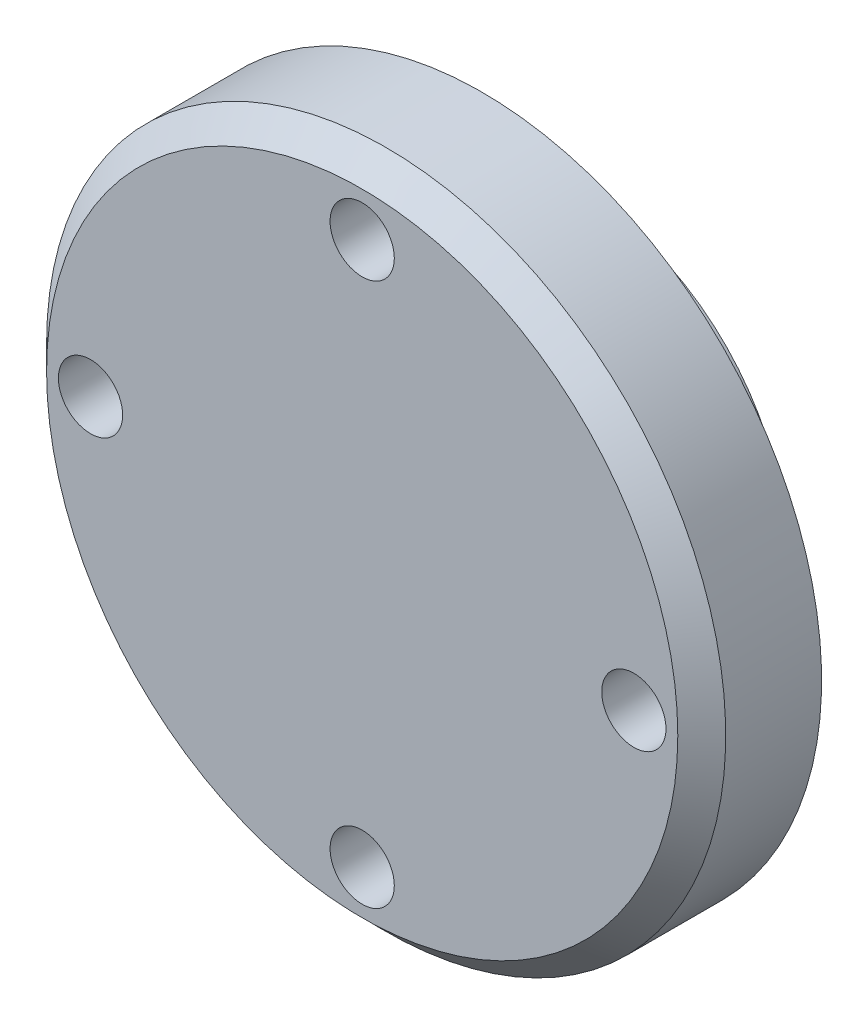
ISO-10303-21;
HEADER;
FILE_DESCRIPTION(('STEP AP214'),'2;1');
FILE_NAME('part.step','',(''),(''),'','','');
FILE_SCHEMA(('AUTOMOTIVE_DESIGN { 1 0 10303 214 1 1 1 1 }'));
ENDSEC;
DATA;
#1=APPLICATION_CONTEXT('core data for automotive mechanical design processes');
#2=APPLICATION_PROTOCOL_DEFINITION('international standard','automotive_design',2000,#1);
#3=PRODUCT_CONTEXT('',#1,'mechanical');
#4=PRODUCT('Part','Part','',(#3));
#5=PRODUCT_RELATED_PRODUCT_CATEGORY('part','',(#4));
#6=PRODUCT_DEFINITION_FORMATION('','',#4);
#7=PRODUCT_DEFINITION_CONTEXT('part definition',#1,'design');
#8=PRODUCT_DEFINITION('design','',#6,#7);
#9=PRODUCT_DEFINITION_SHAPE('','',#8);
#10=(LENGTH_UNIT() NAMED_UNIT(*) SI_UNIT(.MILLI.,.METRE.));
#11=(NAMED_UNIT(*) PLANE_ANGLE_UNIT() SI_UNIT($,.RADIAN.));
#12=(NAMED_UNIT(*) SI_UNIT($,.STERADIAN.) SOLID_ANGLE_UNIT());
#13=UNCERTAINTY_MEASURE_WITH_UNIT(LENGTH_MEASURE(1.E-05),#10,'distance_accuracy_value','');
#14=(GEOMETRIC_REPRESENTATION_CONTEXT(3) GLOBAL_UNCERTAINTY_ASSIGNED_CONTEXT((#13)) GLOBAL_UNIT_ASSIGNED_CONTEXT((#10,
#11,#12)) REPRESENTATION_CONTEXT('',''));
#15=CARTESIAN_POINT('',(0.,0.,0.));
#16=DIRECTION('',(0.,0.,1.));
#17=DIRECTION('',(1.,0.,0.));
#18=AXIS2_PLACEMENT_3D('',#15,#16,#17);
#19=CARTESIAN_POINT('',(0.,0.,-7.62));
#20=DIRECTION('',(0.,0.,1.));
#21=DIRECTION('',(1.,0.,0.));
#22=AXIS2_PLACEMENT_3D('',#19,#20,#21);
#23=CYLINDRICAL_SURFACE('',#22,16.5227);
#24=CARTESIAN_POINT('',(0.,0.,-2.413));
#25=DIRECTION('',(0.,0.,-1.));
#26=DIRECTION('',(-1.,0.,0.));
#27=AXIS2_PLACEMENT_3D('',#24,#25,#26);
#28=CIRCLE('',#27,16.5227);
#29=CARTESIAN_POINT('',(16.5227,0.,-2.413));
#30=VERTEX_POINT('',#29);
#31=EDGE_CURVE('E86',#30,#30,#28,.T.);
#32=CARTESIAN_POINT('',(0.,0.,0.));
#33=DIRECTION('',(0.,0.,1.));
#34=DIRECTION('',(1.,0.,0.));
#35=AXIS2_PLACEMENT_3D('',#32,#33,#34);
#36=CIRCLE('',#35,16.5227);
#37=CARTESIAN_POINT('',(16.5227,0.,0.));
#38=VERTEX_POINT('',#37);
#39=EDGE_CURVE('E74',#38,#38,#36,.F.);
#40=CARTESIAN_POINT('',(16.5227,0.,-2.413));
#41=CARTESIAN_POINT('',(16.5227,0.,-2.38786458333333));
#42=CARTESIAN_POINT('',(16.5227,0.,-2.36272916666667));
#43=CARTESIAN_POINT('',(16.5227,0.,-2.31245833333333));
#44=CARTESIAN_POINT('',(16.5227,0.,-2.28732291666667));
#45=CARTESIAN_POINT('',(16.5227,0.,-2.23705208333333));
#46=CARTESIAN_POINT('',(16.5227,0.,-2.21191666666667));
#47=CARTESIAN_POINT('',(16.5227,0.,-2.16164583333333));
#48=CARTESIAN_POINT('',(16.5227,0.,-2.13651041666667));
#49=CARTESIAN_POINT('',(16.5227,0.,-2.08623958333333));
#50=CARTESIAN_POINT('',(16.5227,0.,-2.06110416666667));
#51=CARTESIAN_POINT('',(16.5227,0.,-2.01083333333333));
#52=CARTESIAN_POINT('',(16.5227,0.,-1.98569791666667));
#53=CARTESIAN_POINT('',(16.5227,0.,-1.93542708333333));
#54=CARTESIAN_POINT('',(16.5227,0.,-1.91029166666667));
#55=CARTESIAN_POINT('',(16.5227,0.,-1.86002083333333));
#56=CARTESIAN_POINT('',(16.5227,0.,-1.83488541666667));
#57=CARTESIAN_POINT('',(16.5227,0.,-1.78461458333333));
#58=CARTESIAN_POINT('',(16.5227,0.,-1.75947916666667));
#59=CARTESIAN_POINT('',(16.5227,0.,-1.70920833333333));
#60=CARTESIAN_POINT('',(16.5227,0.,-1.68407291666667));
#61=CARTESIAN_POINT('',(16.5227,0.,-1.63380208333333));
#62=CARTESIAN_POINT('',(16.5227,0.,-1.60866666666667));
#63=CARTESIAN_POINT('',(16.5227,0.,-1.55839583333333));
#64=CARTESIAN_POINT('',(16.5227,0.,-1.53326041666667));
#65=CARTESIAN_POINT('',(16.5227,0.,-1.48298958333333));
#66=CARTESIAN_POINT('',(16.5227,0.,-1.45785416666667));
#67=CARTESIAN_POINT('',(16.5227,0.,-1.40758333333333));
#68=CARTESIAN_POINT('',(16.5227,0.,-1.38244791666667));
#69=CARTESIAN_POINT('',(16.5227,0.,-1.33217708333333));
#70=CARTESIAN_POINT('',(16.5227,0.,-1.30704166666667));
#71=CARTESIAN_POINT('',(16.5227,0.,-1.25677083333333));
#72=CARTESIAN_POINT('',(16.5227,0.,-1.23163541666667));
#73=CARTESIAN_POINT('',(16.5227,0.,-1.18136458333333));
#74=CARTESIAN_POINT('',(16.5227,0.,-1.15622916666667));
#75=CARTESIAN_POINT('',(16.5227,0.,-1.10595833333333));
#76=CARTESIAN_POINT('',(16.5227,0.,-1.08082291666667));
#77=CARTESIAN_POINT('',(16.5227,0.,-1.03055208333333));
#78=CARTESIAN_POINT('',(16.5227,0.,-1.00541666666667));
#79=CARTESIAN_POINT('',(16.5227,0.,-0.955145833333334));
#80=CARTESIAN_POINT('',(16.5227,0.,-0.930010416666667));
#81=CARTESIAN_POINT('',(16.5227,0.,-0.879739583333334));
#82=CARTESIAN_POINT('',(16.5227,0.,-0.854604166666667));
#83=CARTESIAN_POINT('',(16.5227,0.,-0.804333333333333));
#84=CARTESIAN_POINT('',(16.5227,0.,-0.779197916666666));
#85=CARTESIAN_POINT('',(16.5227,0.,-0.728927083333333));
#86=CARTESIAN_POINT('',(16.5227,0.,-0.703791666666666));
#87=CARTESIAN_POINT('',(16.5227,0.,-0.653520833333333));
#88=CARTESIAN_POINT('',(16.5227,0.,-0.628385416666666));
#89=CARTESIAN_POINT('',(16.5227,0.,-0.578114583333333));
#90=CARTESIAN_POINT('',(16.5227,0.,-0.552979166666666));
#91=CARTESIAN_POINT('',(16.5227,0.,-0.502708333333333));
#92=CARTESIAN_POINT('',(16.5227,0.,-0.477572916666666));
#93=CARTESIAN_POINT('',(16.5227,0.,-0.427302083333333));
#94=CARTESIAN_POINT('',(16.5227,0.,-0.402166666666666));
#95=CARTESIAN_POINT('',(16.5227,0.,-0.351895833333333));
#96=CARTESIAN_POINT('',(16.5227,0.,-0.326760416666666));
#97=CARTESIAN_POINT('',(16.5227,0.,-0.276489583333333));
#98=CARTESIAN_POINT('',(16.5227,0.,-0.251354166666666));
#99=CARTESIAN_POINT('',(16.5227,0.,-0.201083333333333));
#100=CARTESIAN_POINT('',(16.5227,0.,-0.175947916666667));
#101=CARTESIAN_POINT('',(16.5227,0.,-0.125677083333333));
#102=CARTESIAN_POINT('',(16.5227,0.,-0.100541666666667));
#103=CARTESIAN_POINT('',(16.5227,0.,-0.0502708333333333));
#104=CARTESIAN_POINT('',(16.5227,0.,-0.0251354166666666));
#105=CARTESIAN_POINT('',(16.5227,0.,0.));
#106=B_SPLINE_CURVE_WITH_KNOTS('',3,(#40,#41,#42,#43,#44,#45,#46,#47,#48,#49,#50,#51,#52,#53,
#54,#55,#56,#57,#58,#59,#60,#61,#62,#63,#64,#65,#66,#67,#68,#69,#70,#71,#72,#73,#74,#75,#76,#77,
#78,#79,#80,#81,#82,#83,#84,#85,#86,#87,#88,#89,#90,#91,#92,#93,#94,#95,#96,#97,#98,#99,#100,
#101,#102,#103,#104,#105),.UNSPECIFIED.,.F.,.F.,(4,2,2,2,2,2,2,2,2,2,2,2,2,2,2,2,2,2,2,2,2,2,2,
2,2,2,2,2,2,2,2,2,4),(0.,0.07540625,0.1508125,0.22621875,0.301625,0.37703125,0.4524375,
0.52784375,0.60325,0.67865625,0.7540625,0.82946875,0.904875,0.98028125,1.0556875,1.13109375,
1.2065,1.28190625,1.3573125,1.43271875,1.508125,1.58353125,1.6589375,1.73434375,1.80975,
1.88515625,1.9605625,2.03596875,2.111375,2.18678125,2.2621875,2.33759375,2.413),.UNSPECIFIED.);
#107=EDGE_CURVE('BSEAM63',#30,#38,#106,.T.);
#108=ORIENTED_EDGE('',*,*,#31,.F.);
#109=ORIENTED_EDGE('',*,*,#39,.T.);
#110=ORIENTED_EDGE('',*,*,#107,.T.);
#111=ORIENTED_EDGE('',*,*,#107,.F.);
#112=EDGE_LOOP('',(#108,#110,#109,#111));
#113=FACE_BOUND('',#112,.T.);
#114=ADVANCED_FACE('F63',(#113),#23,.T.);
#115=CARTESIAN_POINT('',(0.,0.,0.));
#116=DIRECTION('',(0.,0.,1.));
#117=DIRECTION('',(1.,0.,0.));
#118=AXIS2_PLACEMENT_3D('',#115,#116,#117);
#119=PLANE('',#118);
#120=CARTESIAN_POINT('',(0.,-21.59,0.));
#121=DIRECTION('',(0.,0.,1.));
#122=DIRECTION('',(1.,0.,0.));
#123=AXIS2_PLACEMENT_3D('',#120,#121,#122);
#124=CIRCLE('',#123,2.55269999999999);
#125=CARTESIAN_POINT('',(2.55269999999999,-21.59,0.));
#126=VERTEX_POINT('',#125);
#127=EDGE_CURVE('E116',#126,#126,#124,.T.);
#128=ORIENTED_EDGE('',*,*,#127,.T.);
#129=EDGE_LOOP('',(#128));
#130=FACE_BOUND('',#129,.T.);
#131=CARTESIAN_POINT('',(21.59,0.,0.));
#132=DIRECTION('',(0.,0.,1.));
#133=DIRECTION('',(1.,0.,0.));
#134=AXIS2_PLACEMENT_3D('',#131,#132,#133);
#135=CIRCLE('',#134,2.55269999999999);
#136=CARTESIAN_POINT('',(24.1427,0.,0.));
#137=VERTEX_POINT('',#136);
#138=EDGE_CURVE('E110',#137,#137,#135,.T.);
#139=ORIENTED_EDGE('',*,*,#138,.T.);
#140=EDGE_LOOP('',(#139));
#141=FACE_BOUND('',#140,.T.);
#142=CARTESIAN_POINT('',(0.,21.59,0.));
#143=DIRECTION('',(0.,0.,1.));
#144=DIRECTION('',(1.,0.,0.));
#145=AXIS2_PLACEMENT_3D('',#142,#143,#144);
#146=CIRCLE('',#145,2.55269999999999);
#147=CARTESIAN_POINT('',(2.55269999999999,21.59,0.));
#148=VERTEX_POINT('',#147);
#149=EDGE_CURVE('E104',#148,#148,#146,.T.);
#150=ORIENTED_EDGE('',*,*,#149,.T.);
#151=EDGE_LOOP('',(#150));
#152=FACE_BOUND('',#151,.T.);
#153=CARTESIAN_POINT('',(-21.59,0.,0.));
#154=DIRECTION('',(0.,0.,1.));
#155=DIRECTION('',(1.,0.,0.));
#156=AXIS2_PLACEMENT_3D('',#153,#154,#155);
#157=CIRCLE('',#156,2.55269999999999);
#158=CARTESIAN_POINT('',(-19.0373,0.,0.));
#159=VERTEX_POINT('',#158);
#160=EDGE_CURVE('E98',#159,#159,#157,.T.);
#161=ORIENTED_EDGE('',*,*,#160,.T.);
#162=EDGE_LOOP('',(#161));
#163=FACE_BOUND('',#162,.T.);
#164=CARTESIAN_POINT('',(0.,0.,0.));
#165=DIRECTION('',(0.,0.,1.));
#166=DIRECTION('',(1.,0.,0.));
#167=AXIS2_PLACEMENT_3D('',#164,#165,#166);
#168=CIRCLE('',#167,26.9875);
#169=CARTESIAN_POINT('',(-26.9875,0.,0.));
#170=VERTEX_POINT('',#169);
#171=EDGE_CURVE('E78',#170,#170,#168,.T.);
#172=ORIENTED_EDGE('',*,*,#171,.F.);
#173=EDGE_LOOP('',(#172));
#174=FACE_BOUND('',#173,.T.);
#175=ORIENTED_EDGE('',*,*,#39,.F.);
#176=EDGE_LOOP('',(#175));
#177=FACE_BOUND('',#176,.T.);
#178=ADVANCED_FACE('F156',(#130,#141,#152,#163,#174,#177),#119,.F.);
#179=CARTESIAN_POINT('',(0.,0.,9.525));
#180=DIRECTION('',(0.,0.,-1.));
#181=DIRECTION('',(-1.,0.,0.));
#182=AXIS2_PLACEMENT_3D('',#179,#180,#181);
#183=CYLINDRICAL_SURFACE('',#182,26.9875);
#184=CARTESIAN_POINT('',(0.,0.,7.62000000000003));
#185=DIRECTION('',(0.,0.,1.));
#186=DIRECTION('',(1.,0.,0.));
#187=AXIS2_PLACEMENT_3D('',#184,#185,#186);
#188=CIRCLE('',#187,26.9875);
#189=CARTESIAN_POINT('',(-26.9875,0.,7.62000000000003));
#190=VERTEX_POINT('',#189);
#191=EDGE_CURVE('E11',#190,#190,#188,.F.);
#192=CARTESIAN_POINT('',(-26.9875,0.,7.62000000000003));
#193=CARTESIAN_POINT('',(-26.9875,0.,7.54062500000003));
#194=CARTESIAN_POINT('',(-26.9875,0.,7.46125000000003));
#195=CARTESIAN_POINT('',(-26.9875,0.,7.30250000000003));
#196=CARTESIAN_POINT('',(-26.9875,0.,7.22312500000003));
#197=CARTESIAN_POINT('',(-26.9875,0.,7.06437500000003));
#198=CARTESIAN_POINT('',(-26.9875,0.,6.98500000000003));
#199=CARTESIAN_POINT('',(-26.9875,0.,6.82625000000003));
#200=CARTESIAN_POINT('',(-26.9875,0.,6.74687500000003));
#201=CARTESIAN_POINT('',(-26.9875,0.,6.58812500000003));
#202=CARTESIAN_POINT('',(-26.9875,0.,6.50875000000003));
#203=CARTESIAN_POINT('',(-26.9875,0.,6.35000000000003));
#204=CARTESIAN_POINT('',(-26.9875,0.,6.27062500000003));
#205=CARTESIAN_POINT('',(-26.9875,0.,6.11187500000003));
#206=CARTESIAN_POINT('',(-26.9875,0.,6.03250000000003));
#207=CARTESIAN_POINT('',(-26.9875,0.,5.87375000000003));
#208=CARTESIAN_POINT('',(-26.9875,0.,5.79437500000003));
#209=CARTESIAN_POINT('',(-26.9875,0.,5.63562500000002));
#210=CARTESIAN_POINT('',(-26.9875,0.,5.55625000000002));
#211=CARTESIAN_POINT('',(-26.9875,0.,5.39750000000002));
#212=CARTESIAN_POINT('',(-26.9875,0.,5.31812500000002));
#213=CARTESIAN_POINT('',(-26.9875,0.,5.15937500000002));
#214=CARTESIAN_POINT('',(-26.9875,0.,5.08000000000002));
#215=CARTESIAN_POINT('',(-26.9875,0.,4.92125000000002));
#216=CARTESIAN_POINT('',(-26.9875,0.,4.84187500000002));
#217=CARTESIAN_POINT('',(-26.9875,0.,4.68312500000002));
#218=CARTESIAN_POINT('',(-26.9875,0.,4.60375000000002));
#219=CARTESIAN_POINT('',(-26.9875,0.,4.44500000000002));
#220=CARTESIAN_POINT('',(-26.9875,0.,4.36562500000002));
#221=CARTESIAN_POINT('',(-26.9875,0.,4.20687500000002));
#222=CARTESIAN_POINT('',(-26.9875,0.,4.12750000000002));
#223=CARTESIAN_POINT('',(-26.9875,0.,3.96875000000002));
#224=CARTESIAN_POINT('',(-26.9875,0.,3.88937500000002));
#225=CARTESIAN_POINT('',(-26.9875,0.,3.73062500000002));
#226=CARTESIAN_POINT('',(-26.9875,0.,3.65125000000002));
#227=CARTESIAN_POINT('',(-26.9875,0.,3.49250000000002));
#228=CARTESIAN_POINT('',(-26.9875,0.,3.41312500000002));
#229=CARTESIAN_POINT('',(-26.9875,0.,3.25437500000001));
#230=CARTESIAN_POINT('',(-26.9875,0.,3.17500000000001));
#231=CARTESIAN_POINT('',(-26.9875,0.,3.01625000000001));
#232=CARTESIAN_POINT('',(-26.9875,0.,2.93687500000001));
#233=CARTESIAN_POINT('',(-26.9875,0.,2.77812500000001));
#234=CARTESIAN_POINT('',(-26.9875,0.,2.69875000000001));
#235=CARTESIAN_POINT('',(-26.9875,0.,2.54000000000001));
#236=CARTESIAN_POINT('',(-26.9875,0.,2.46062500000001));
#237=CARTESIAN_POINT('',(-26.9875,0.,2.30187500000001));
#238=CARTESIAN_POINT('',(-26.9875,0.,2.22250000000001));
#239=CARTESIAN_POINT('',(-26.9875,0.,2.06375000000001));
#240=CARTESIAN_POINT('',(-26.9875,0.,1.98437500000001));
#241=CARTESIAN_POINT('',(-26.9875,0.,1.82562500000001));
#242=CARTESIAN_POINT('',(-26.9875,0.,1.74625000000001));
#243=CARTESIAN_POINT('',(-26.9875,0.,1.58750000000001));
#244=CARTESIAN_POINT('',(-26.9875,0.,1.50812500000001));
#245=CARTESIAN_POINT('',(-26.9875,0.,1.34937500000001));
#246=CARTESIAN_POINT('',(-26.9875,0.,1.27000000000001));
#247=CARTESIAN_POINT('',(-26.9875,0.,1.11125000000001));
#248=CARTESIAN_POINT('',(-26.9875,0.,1.03187500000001));
#249=CARTESIAN_POINT('',(-26.9875,0.,0.873125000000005));
#250=CARTESIAN_POINT('',(-26.9875,0.,0.793750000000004));
#251=CARTESIAN_POINT('',(-26.9875,0.,0.635000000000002));
#252=CARTESIAN_POINT('',(-26.9875,0.,0.555625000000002));
#253=CARTESIAN_POINT('',(-26.9875,0.,0.396875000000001));
#254=CARTESIAN_POINT('',(-26.9875,0.,0.317500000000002));
#255=CARTESIAN_POINT('',(-26.9875,0.,0.158750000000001));
#256=CARTESIAN_POINT('',(-26.9875,0.,0.0793750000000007));
#257=CARTESIAN_POINT('',(-26.9875,0.,0.));
#258=B_SPLINE_CURVE_WITH_KNOTS('',3,(#192,#193,#194,#195,#196,#197,#198,#199,#200,#201,#202,
#203,#204,#205,#206,#207,#208,#209,#210,#211,#212,#213,#214,#215,#216,#217,#218,#219,#220,#221,
#222,#223,#224,#225,#226,#227,#228,#229,#230,#231,#232,#233,#234,#235,#236,#237,#238,#239,#240,
#241,#242,#243,#244,#245,#246,#247,#248,#249,#250,#251,#252,#253,#254,#255,#256,#257),
.UNSPECIFIED.,.F.,.F.,(4,2,2,2,2,2,2,2,2,2,2,2,2,2,2,2,2,2,2,2,2,2,2,2,2,2,2,2,2,2,2,2,4),(0.,
0.238125,0.476250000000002,0.714375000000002,0.952500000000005,1.19062500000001,
1.42875000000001,1.66687500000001,1.90500000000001,2.14312500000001,2.38125000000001,
2.61937500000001,2.85750000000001,3.09562500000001,3.33375000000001,3.57187500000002,
3.81000000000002,4.04812500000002,4.28625000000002,4.52437500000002,4.76250000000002,
5.00062500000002,5.23875000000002,5.47687500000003,5.71500000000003,5.95312500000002,
6.19125000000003,6.42937500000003,6.66750000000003,6.90562500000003,7.14375000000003,
7.38187500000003,7.62000000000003),.UNSPECIFIED.);
#259=EDGE_CURVE('BSEAM129',#190,#170,#258,.T.);
#260=ORIENTED_EDGE('',*,*,#191,.T.);
#261=ORIENTED_EDGE('',*,*,#171,.T.);
#262=ORIENTED_EDGE('',*,*,#259,.T.);
#263=ORIENTED_EDGE('',*,*,#259,.F.);
#264=EDGE_LOOP('',(#260,#262,#261,#263));
#265=FACE_BOUND('',#264,.T.);
#266=ADVANCED_FACE('F129',(#265),#183,.T.);
#267=CARTESIAN_POINT('',(0.,0.,9.525));
#268=DIRECTION('',(0.,0.,1.));
#269=DIRECTION('',(1.,0.,0.));
#270=AXIS2_PLACEMENT_3D('',#267,#268,#269);
#271=PLANE('',#270);
#272=CARTESIAN_POINT('',(0.,0.,9.525));
#273=DIRECTION('',(0.,0.,1.));
#274=DIRECTION('',(1.,0.,0.));
#275=AXIS2_PLACEMENT_3D('',#272,#273,#274);
#276=CIRCLE('',#275,25.0825);
#277=CARTESIAN_POINT('',(25.0825,0.,9.525));
#278=VERTEX_POINT('',#277);
#279=EDGE_CURVE('E70',#278,#278,#276,.T.);
#280=ORIENTED_EDGE('',*,*,#279,.T.);
#281=EDGE_LOOP('',(#280));
#282=FACE_BOUND('',#281,.T.);
#283=CARTESIAN_POINT('',(0.,-21.59,9.525));
#284=DIRECTION('',(0.,0.,1.));
#285=DIRECTION('',(1.,0.,0.));
#286=AXIS2_PLACEMENT_3D('',#283,#284,#285);
#287=CIRCLE('',#286,2.55269999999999);
#288=CARTESIAN_POINT('',(2.55269999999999,-21.59,9.525));
#289=VERTEX_POINT('',#288);
#290=EDGE_CURVE('E119',#289,#289,#287,.T.);
#291=ORIENTED_EDGE('',*,*,#290,.F.);
#292=EDGE_LOOP('',(#291));
#293=FACE_BOUND('',#292,.T.);
#294=CARTESIAN_POINT('',(21.59,0.,9.525));
#295=DIRECTION('',(0.,0.,1.));
#296=DIRECTION('',(1.,0.,0.));
#297=AXIS2_PLACEMENT_3D('',#294,#295,#296);
#298=CIRCLE('',#297,2.55269999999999);
#299=CARTESIAN_POINT('',(24.1427,0.,9.525));
#300=VERTEX_POINT('',#299);
#301=EDGE_CURVE('E113',#300,#300,#298,.T.);
#302=ORIENTED_EDGE('',*,*,#301,.F.);
#303=EDGE_LOOP('',(#302));
#304=FACE_BOUND('',#303,.T.);
#305=CARTESIAN_POINT('',(0.,21.59,9.525));
#306=DIRECTION('',(0.,0.,1.));
#307=DIRECTION('',(1.,0.,0.));
#308=AXIS2_PLACEMENT_3D('',#305,#306,#307);
#309=CIRCLE('',#308,2.55269999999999);
#310=CARTESIAN_POINT('',(2.55269999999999,21.59,9.525));
#311=VERTEX_POINT('',#310);
#312=EDGE_CURVE('E107',#311,#311,#309,.T.);
#313=ORIENTED_EDGE('',*,*,#312,.F.);
#314=EDGE_LOOP('',(#313));
#315=FACE_BOUND('',#314,.T.);
#316=CARTESIAN_POINT('',(-21.59,0.,9.525));
#317=DIRECTION('',(0.,0.,1.));
#318=DIRECTION('',(1.,0.,0.));
#319=AXIS2_PLACEMENT_3D('',#316,#317,#318);
#320=CIRCLE('',#319,2.55269999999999);
#321=CARTESIAN_POINT('',(-19.0373,0.,9.525));
#322=VERTEX_POINT('',#321);
#323=EDGE_CURVE('E101',#322,#322,#320,.T.);
#324=ORIENTED_EDGE('',*,*,#323,.F.);
#325=EDGE_LOOP('',(#324));
#326=FACE_BOUND('',#325,.T.);
#327=ADVANCED_FACE('F125',(#282,#293,#304,#315,#326),#271,.T.);
#328=CARTESIAN_POINT('',(-16.5227,0.,-2.413));
#329=DIRECTION('',(0.,0.,1.));
#330=DIRECTION('',(1.,0.,0.));
#331=AXIS2_PLACEMENT_3D('',#328,#329,#330);
#332=PLANE('',#331);
#333=CARTESIAN_POINT('',(0.,0.,-2.413));
#334=DIRECTION('',(0.,0.,-1.));
#335=DIRECTION('',(-1.,0.,0.));
#336=AXIS2_PLACEMENT_3D('',#333,#334,#335);
#337=CIRCLE('',#336,15.1765);
#338=CARTESIAN_POINT('',(-15.1765,0.,-2.413));
#339=VERTEX_POINT('',#338);
#340=EDGE_CURVE('E89',#339,#339,#337,.T.);
#341=ORIENTED_EDGE('',*,*,#340,.F.);
#342=EDGE_LOOP('',(#341));
#343=FACE_BOUND('',#342,.T.);
#344=ORIENTED_EDGE('',*,*,#31,.T.);
#345=EDGE_LOOP('',(#344));
#346=FACE_BOUND('',#345,.T.);
#347=ADVANCED_FACE('F128',(#343,#346),#332,.F.);
#348=CARTESIAN_POINT('',(0.,0.,-8.47725));
#349=DIRECTION('',(0.,0.,-1.));
#350=DIRECTION('',(-1.,0.,0.));
#351=AXIS2_PLACEMENT_3D('',#348,#349,#350);
#352=CYLINDRICAL_SURFACE('',#351,15.1765);
#353=CARTESIAN_POINT('',(0.,0.,-5.08));
#354=DIRECTION('',(0.,0.,-1.));
#355=DIRECTION('',(-1.,0.,0.));
#356=AXIS2_PLACEMENT_3D('',#353,#354,#355);
#357=CIRCLE('',#356,15.1765);
#358=CARTESIAN_POINT('',(-15.1765,0.,-5.08));
#359=VERTEX_POINT('',#358);
#360=EDGE_CURVE('E92',#359,#359,#357,.T.);
#361=ORIENTED_EDGE('',*,*,#360,.F.);
#362=EDGE_LOOP('',(#361));
#363=FACE_BOUND('',#362,.T.);
#364=ORIENTED_EDGE('',*,*,#340,.T.);
#365=EDGE_LOOP('',(#364));
#366=FACE_BOUND('',#365,.T.);
#367=ADVANCED_FACE('F189',(#363,#366),#352,.T.);
#368=CARTESIAN_POINT('',(-15.1765,0.,-5.08));
#369=DIRECTION('',(0.,0.,-1.));
#370=DIRECTION('',(-1.,0.,0.));
#371=AXIS2_PLACEMENT_3D('',#368,#369,#370);
#372=PLANE('',#371);
#373=CARTESIAN_POINT('',(0.,0.,-5.08));
#374=DIRECTION('',(0.,0.,-1.));
#375=DIRECTION('',(-1.,0.,0.));
#376=AXIS2_PLACEMENT_3D('',#373,#374,#375);
#377=CIRCLE('',#376,16.5227);
#378=CARTESIAN_POINT('',(16.5227,0.,-5.08));
#379=VERTEX_POINT('',#378);
#380=EDGE_CURVE('E95',#379,#379,#377,.T.);
#381=ORIENTED_EDGE('',*,*,#380,.F.);
#382=EDGE_LOOP('',(#381));
#383=FACE_BOUND('',#382,.T.);
#384=ORIENTED_EDGE('',*,*,#360,.T.);
#385=EDGE_LOOP('',(#384));
#386=FACE_BOUND('',#385,.T.);
#387=ADVANCED_FACE('F196',(#383,#386),#372,.F.);
#388=CARTESIAN_POINT('',(0.,0.,-7.62));
#389=DIRECTION('',(0.,0.,-1.));
#390=DIRECTION('',(-1.,0.,0.));
#391=AXIS2_PLACEMENT_3D('',#388,#389,#390);
#392=PLANE('',#391);
#393=CARTESIAN_POINT('',(0.,0.,-7.62));
#394=DIRECTION('',(0.,0.,-1.));
#395=DIRECTION('',(-1.,0.,0.));
#396=AXIS2_PLACEMENT_3D('',#393,#394,#395);
#397=CIRCLE('',#396,16.5227);
#398=CARTESIAN_POINT('',(16.5227,0.,-7.62));
#399=VERTEX_POINT('',#398);
#400=EDGE_CURVE('E83',#399,#399,#397,.T.);
#401=ORIENTED_EDGE('',*,*,#400,.T.);
#402=EDGE_LOOP('',(#401));
#403=FACE_BOUND('',#402,.T.);
#404=ADVANCED_FACE('F150',(#403),#392,.T.);
#405=CARTESIAN_POINT('',(16.5227,0.,-5.08));
#406=CARTESIAN_POINT('',(16.5227,0.,-5.10645833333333));
#407=CARTESIAN_POINT('',(16.5227,0.,-5.13291666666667));
#408=CARTESIAN_POINT('',(16.5227,0.,-5.18583333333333));
#409=CARTESIAN_POINT('',(16.5227,0.,-5.21229166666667));
#410=CARTESIAN_POINT('',(16.5227,0.,-5.26520833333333));
#411=CARTESIAN_POINT('',(16.5227,0.,-5.29166666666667));
#412=CARTESIAN_POINT('',(16.5227,0.,-5.34458333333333));
#413=CARTESIAN_POINT('',(16.5227,0.,-5.37104166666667));
#414=CARTESIAN_POINT('',(16.5227,0.,-5.42395833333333));
#415=CARTESIAN_POINT('',(16.5227,0.,-5.45041666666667));
#416=CARTESIAN_POINT('',(16.5227,0.,-5.50333333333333));
#417=CARTESIAN_POINT('',(16.5227,0.,-5.52979166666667));
#418=CARTESIAN_POINT('',(16.5227,0.,-5.58270833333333));
#419=CARTESIAN_POINT('',(16.5227,0.,-5.60916666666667));
#420=CARTESIAN_POINT('',(16.5227,0.,-5.66208333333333));
#421=CARTESIAN_POINT('',(16.5227,0.,-5.68854166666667));
#422=CARTESIAN_POINT('',(16.5227,0.,-5.74145833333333));
#423=CARTESIAN_POINT('',(16.5227,0.,-5.76791666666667));
#424=CARTESIAN_POINT('',(16.5227,0.,-5.82083333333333));
#425=CARTESIAN_POINT('',(16.5227,0.,-5.84729166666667));
#426=CARTESIAN_POINT('',(16.5227,0.,-5.90020833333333));
#427=CARTESIAN_POINT('',(16.5227,0.,-5.92666666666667));
#428=CARTESIAN_POINT('',(16.5227,0.,-5.97958333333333));
#429=CARTESIAN_POINT('',(16.5227,0.,-6.00604166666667));
#430=CARTESIAN_POINT('',(16.5227,0.,-6.05895833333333));
#431=CARTESIAN_POINT('',(16.5227,0.,-6.08541666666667));
#432=CARTESIAN_POINT('',(16.5227,0.,-6.13833333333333));
#433=CARTESIAN_POINT('',(16.5227,0.,-6.16479166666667));
#434=CARTESIAN_POINT('',(16.5227,0.,-6.21770833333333));
#435=CARTESIAN_POINT('',(16.5227,0.,-6.24416666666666));
#436=CARTESIAN_POINT('',(16.5227,0.,-6.29708333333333));
#437=CARTESIAN_POINT('',(16.5227,0.,-6.32354166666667));
#438=CARTESIAN_POINT('',(16.5227,0.,-6.37645833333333));
#439=CARTESIAN_POINT('',(16.5227,0.,-6.40291666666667));
#440=CARTESIAN_POINT('',(16.5227,0.,-6.45583333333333));
#441=CARTESIAN_POINT('',(16.5227,0.,-6.48229166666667));
#442=CARTESIAN_POINT('',(16.5227,0.,-6.53520833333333));
#443=CARTESIAN_POINT('',(16.5227,0.,-6.56166666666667));
#444=CARTESIAN_POINT('',(16.5227,0.,-6.61458333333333));
#445=CARTESIAN_POINT('',(16.5227,0.,-6.64104166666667));
#446=CARTESIAN_POINT('',(16.5227,0.,-6.69395833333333));
#447=CARTESIAN_POINT('',(16.5227,0.,-6.72041666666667));
#448=CARTESIAN_POINT('',(16.5227,0.,-6.77333333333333));
#449=CARTESIAN_POINT('',(16.5227,0.,-6.79979166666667));
#450=CARTESIAN_POINT('',(16.5227,0.,-6.85270833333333));
#451=CARTESIAN_POINT('',(16.5227,0.,-6.87916666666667));
#452=CARTESIAN_POINT('',(16.5227,0.,-6.93208333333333));
#453=CARTESIAN_POINT('',(16.5227,0.,-6.95854166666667));
#454=CARTESIAN_POINT('',(16.5227,0.,-7.01145833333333));
#455=CARTESIAN_POINT('',(16.5227,0.,-7.03791666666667));
#456=CARTESIAN_POINT('',(16.5227,0.,-7.09083333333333));
#457=CARTESIAN_POINT('',(16.5227,0.,-7.11729166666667));
#458=CARTESIAN_POINT('',(16.5227,0.,-7.17020833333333));
#459=CARTESIAN_POINT('',(16.5227,0.,-7.19666666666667));
#460=CARTESIAN_POINT('',(16.5227,0.,-7.24958333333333));
#461=CARTESIAN_POINT('',(16.5227,0.,-7.27604166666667));
#462=CARTESIAN_POINT('',(16.5227,0.,-7.32895833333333));
#463=CARTESIAN_POINT('',(16.5227,0.,-7.35541666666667));
#464=CARTESIAN_POINT('',(16.5227,0.,-7.40833333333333));
#465=CARTESIAN_POINT('',(16.5227,0.,-7.43479166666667));
#466=CARTESIAN_POINT('',(16.5227,0.,-7.48770833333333));
#467=CARTESIAN_POINT('',(16.5227,0.,-7.51416666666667));
#468=CARTESIAN_POINT('',(16.5227,0.,-7.56708333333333));
#469=CARTESIAN_POINT('',(16.5227,0.,-7.59354166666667));
#470=CARTESIAN_POINT('',(16.5227,0.,-7.62));
#471=B_SPLINE_CURVE_WITH_KNOTS('',3,(#405,#406,#407,#408,#409,#410,#411,#412,#413,#414,#415,
#416,#417,#418,#419,#420,#421,#422,#423,#424,#425,#426,#427,#428,#429,#430,#431,#432,#433,#434,
#435,#436,#437,#438,#439,#440,#441,#442,#443,#444,#445,#446,#447,#448,#449,#450,#451,#452,#453,
#454,#455,#456,#457,#458,#459,#460,#461,#462,#463,#464,#465,#466,#467,#468,#469,#470),
.UNSPECIFIED.,.F.,.F.,(4,2,2,2,2,2,2,2,2,2,2,2,2,2,2,2,2,2,2,2,2,2,2,2,2,2,2,2,2,2,2,2,4),(0.,
0.0793749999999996,0.158749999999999,0.238125,0.3175,0.396875,0.476249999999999,0.555625,
0.634999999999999,0.714375,0.793749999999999,0.873125,0.952499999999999,1.031875,1.11125,
1.190625,1.27,1.349375,1.42875,1.508125,1.5875,1.666875,1.74625,1.825625,1.905,1.984375,2.06375,
2.143125,2.2225,2.301875,2.38125,2.460625,2.54),.UNSPECIFIED.);
#472=EDGE_CURVE('BSEAM140',#379,#399,#471,.T.);
#473=ORIENTED_EDGE('',*,*,#380,.T.);
#474=ORIENTED_EDGE('',*,*,#400,.F.);
#475=ORIENTED_EDGE('',*,*,#472,.T.);
#476=ORIENTED_EDGE('',*,*,#472,.F.);
#477=EDGE_LOOP('',(#473,#475,#474,#476));
#478=FACE_BOUND('',#477,.T.);
#479=ADVANCED_FACE('F140',(#478),#23,.T.);
#480=CARTESIAN_POINT('',(-21.59,0.,9.525));
#481=DIRECTION('',(0.,0.,1.));
#482=DIRECTION('',(1.,0.,0.));
#483=AXIS2_PLACEMENT_3D('',#480,#481,#482);
#484=CYLINDRICAL_SURFACE('',#483,2.55269999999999);
#485=ORIENTED_EDGE('',*,*,#160,.F.);
#486=EDGE_LOOP('',(#485));
#487=FACE_BOUND('',#486,.T.);
#488=ORIENTED_EDGE('',*,*,#323,.T.);
#489=EDGE_LOOP('',(#488));
#490=FACE_BOUND('',#489,.T.);
#491=ADVANCED_FACE('F137',(#487,#490),#484,.F.);
#492=CARTESIAN_POINT('',(0.,21.59,9.525));
#493=DIRECTION('',(0.,0.,1.));
#494=DIRECTION('',(1.,0.,0.));
#495=AXIS2_PLACEMENT_3D('',#492,#493,#494);
#496=CYLINDRICAL_SURFACE('',#495,2.55269999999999);
#497=ORIENTED_EDGE('',*,*,#149,.F.);
#498=EDGE_LOOP('',(#497));
#499=FACE_BOUND('',#498,.T.);
#500=ORIENTED_EDGE('',*,*,#312,.T.);
#501=EDGE_LOOP('',(#500));
#502=FACE_BOUND('',#501,.T.);
#503=ADVANCED_FACE('F139',(#499,#502),#496,.F.);
#504=CARTESIAN_POINT('',(21.59,0.,9.525));
#505=DIRECTION('',(0.,0.,1.));
#506=DIRECTION('',(1.,0.,0.));
#507=AXIS2_PLACEMENT_3D('',#504,#505,#506);
#508=CYLINDRICAL_SURFACE('',#507,2.55269999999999);
#509=ORIENTED_EDGE('',*,*,#138,.F.);
#510=EDGE_LOOP('',(#509));
#511=FACE_BOUND('',#510,.T.);
#512=ORIENTED_EDGE('',*,*,#301,.T.);
#513=EDGE_LOOP('',(#512));
#514=FACE_BOUND('',#513,.T.);
#515=ADVANCED_FACE('F147',(#511,#514),#508,.F.);
#516=CARTESIAN_POINT('',(0.,-21.59,9.525));
#517=DIRECTION('',(0.,0.,1.));
#518=DIRECTION('',(1.,0.,0.));
#519=AXIS2_PLACEMENT_3D('',#516,#517,#518);
#520=CYLINDRICAL_SURFACE('',#519,2.55269999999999);
#521=ORIENTED_EDGE('',*,*,#127,.F.);
#522=EDGE_LOOP('',(#521));
#523=FACE_BOUND('',#522,.T.);
#524=ORIENTED_EDGE('',*,*,#290,.T.);
#525=EDGE_LOOP('',(#524));
#526=FACE_BOUND('',#525,.T.);
#527=ADVANCED_FACE('F123',(#523,#526),#520,.F.);
#528=CARTESIAN_POINT('',(0.,0.,9.525));
#529=DIRECTION('',(0.,0.,-1.));
#530=DIRECTION('',(-1.,0.,0.));
#531=AXIS2_PLACEMENT_3D('',#528,#529,#530);
#532=CONICAL_SURFACE('',#531,25.0825,0.785398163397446);
#533=ORIENTED_EDGE('',*,*,#191,.F.);
#534=EDGE_LOOP('',(#533));
#535=FACE_BOUND('',#534,.T.);
#536=ORIENTED_EDGE('',*,*,#279,.F.);
#537=EDGE_LOOP('',(#536));
#538=FACE_BOUND('',#537,.T.);
#539=ADVANCED_FACE('F65',(#535,#538),#532,.T.);
#540=CLOSED_SHELL('',(#114,#178,#266,#327,#347,#367,#387,#404,#479,#491,#503,#515,#527,#539));
#541=MANIFOLD_SOLID_BREP('B2',#540);
#542=ADVANCED_BREP_SHAPE_REPRESENTATION('',(#18,#541),#14);
#543=SHAPE_DEFINITION_REPRESENTATION(#9,#542);
ENDSEC;
END-ISO-10303-21;
